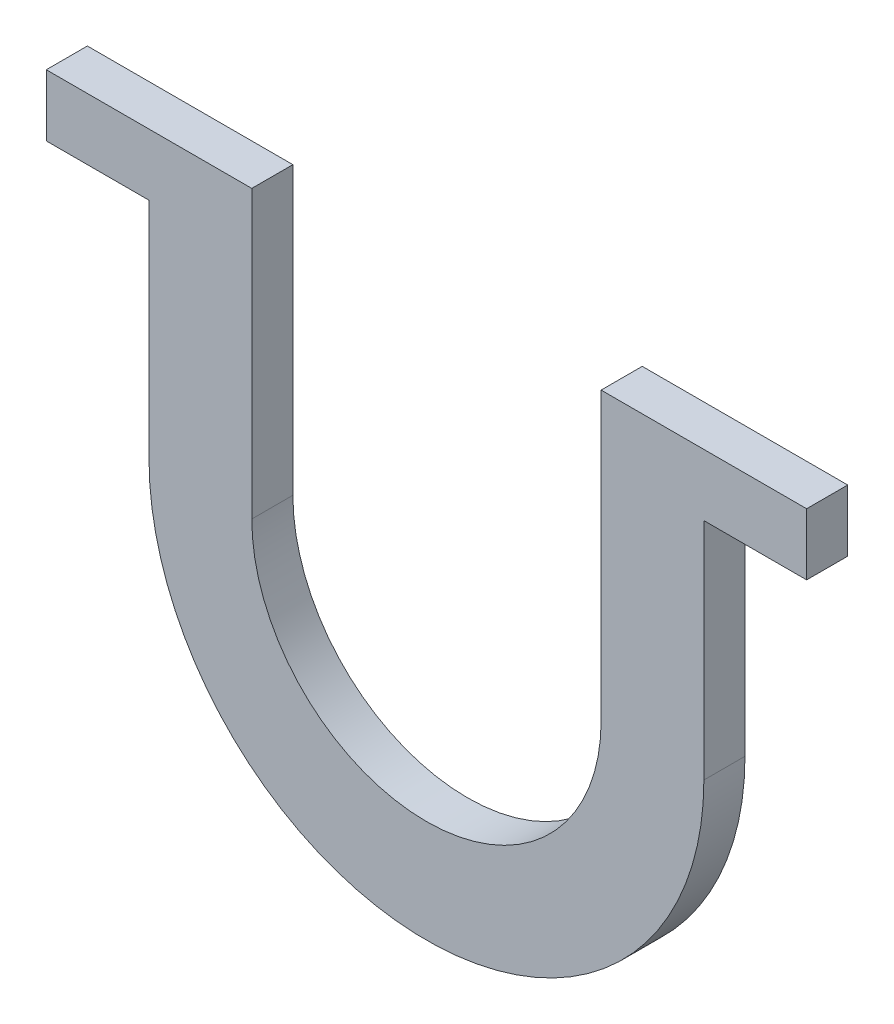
from build123d import *

# Parameters (mm, degrees)
BOSS_EXTRUDE1_DEPTH = 4
SKETCH4_W           = 4
SKETCH4_H           = 6
BOSS_EXTRUDE4_DEPTH = 10
SKETCH5_W           = 4
SKETCH5_H           = 6
BOSS_EXTRUDE5_DEPTH = 10


with BuildPart() as part:
    # Sketch1 → Boss-Extrude1 (new body)
    with BuildSketch(Plane.XY):
        with BuildLine():
            Line((-41.989268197, 29.460819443), (-41.989268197, 1.593348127))
            ThreePointArc((-41.989268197, 1.593348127), (-14.989268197, -25.406651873), (12.010731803, 1.593348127))
            Line((12.010731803, 1.593348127), (12.010731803, 29.460819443))
            Line((12.010731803, 29.460819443), (2.010731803, 29.460819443))
            Line((2.010731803, 29.460819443), (2.010731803, 1.593348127))
            ThreePointArc((2.010731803, 1.593348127), (-14.989268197, -15.406651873), (-31.989268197, 1.593348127))
            Line((-31.989268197, 1.593348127), (-31.989268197, 29.460819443))
            Line((-31.989268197, 29.460819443), (-41.989268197, 29.460819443))
        make_face()
    extrude(amount=BOSS_EXTRUDE1_DEPTH)

    # Sketch4 → Boss-Extrude4 (add)
    with BuildSketch(Plane(origin=(12.010731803, 0, 0), x_dir=(0, 0, -1), z_dir=(1, 0, 0))):
        with Locations((-2, 26.460819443)):
            Rectangle(SKETCH4_W, SKETCH4_H)
    extrude(amount=BOSS_EXTRUDE4_DEPTH)

    # Sketch5 → Boss-Extrude5 (add)
    with BuildSketch(Plane.ZY.offset(41.989268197)):
        with Locations((2, 26.460819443)):
            Rectangle(SKETCH5_W, SKETCH5_H)
    extrude(amount=BOSS_EXTRUDE5_DEPTH)


solid = part.part
